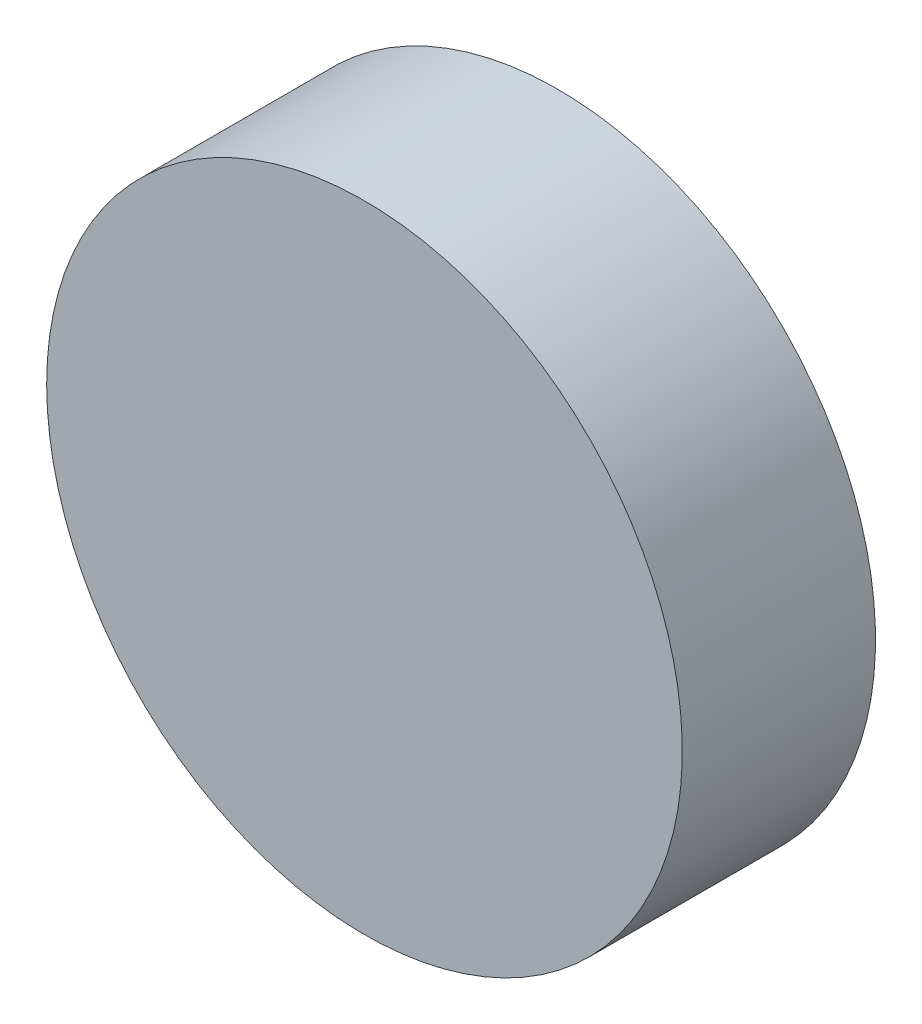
ISO-10303-21;
HEADER;
FILE_DESCRIPTION(('STEP AP214'),'2;1');
FILE_NAME('part.step','',(''),(''),'','','');
FILE_SCHEMA(('AUTOMOTIVE_DESIGN { 1 0 10303 214 1 1 1 1 }'));
ENDSEC;
DATA;
#1=APPLICATION_CONTEXT('core data for automotive mechanical design processes');
#2=APPLICATION_PROTOCOL_DEFINITION('international standard','automotive_design',2000,#1);
#3=PRODUCT_CONTEXT('',#1,'mechanical');
#4=PRODUCT('Part','Part','',(#3));
#5=PRODUCT_RELATED_PRODUCT_CATEGORY('part','',(#4));
#6=PRODUCT_DEFINITION_FORMATION('','',#4);
#7=PRODUCT_DEFINITION_CONTEXT('part definition',#1,'design');
#8=PRODUCT_DEFINITION('design','',#6,#7);
#9=PRODUCT_DEFINITION_SHAPE('','',#8);
#10=(LENGTH_UNIT() NAMED_UNIT(*) SI_UNIT(.MILLI.,.METRE.));
#11=(NAMED_UNIT(*) PLANE_ANGLE_UNIT() SI_UNIT($,.RADIAN.));
#12=(NAMED_UNIT(*) SI_UNIT($,.STERADIAN.) SOLID_ANGLE_UNIT());
#13=UNCERTAINTY_MEASURE_WITH_UNIT(LENGTH_MEASURE(1.E-05),#10,'distance_accuracy_value','');
#14=(GEOMETRIC_REPRESENTATION_CONTEXT(3) GLOBAL_UNCERTAINTY_ASSIGNED_CONTEXT((#13)) GLOBAL_UNIT_ASSIGNED_CONTEXT((#10,
#11,#12)) REPRESENTATION_CONTEXT('',''));
#15=CARTESIAN_POINT('',(0.,0.,0.));
#16=DIRECTION('',(0.,0.,1.));
#17=DIRECTION('',(1.,0.,0.));
#18=AXIS2_PLACEMENT_3D('',#15,#16,#17);
#19=CARTESIAN_POINT('',(0.,0.,3.8));
#20=DIRECTION('',(0.,0.,-1.));
#21=DIRECTION('',(-1.,0.,0.));
#22=AXIS2_PLACEMENT_3D('',#19,#20,#21);
#23=CYLINDRICAL_SURFACE('',#22,6.25);
#24=CARTESIAN_POINT('',(0.,0.,3.8));
#25=DIRECTION('',(0.,0.,1.));
#26=DIRECTION('',(1.,0.,0.));
#27=AXIS2_PLACEMENT_3D('',#24,#25,#26);
#28=CIRCLE('',#27,6.25);
#29=CARTESIAN_POINT('',(-6.25,0.,3.8));
#30=VERTEX_POINT('',#29);
#31=EDGE_CURVE('E10',#30,#30,#28,.T.);
#32=CARTESIAN_POINT('',(0.,0.,0.));
#33=DIRECTION('',(0.,0.,1.));
#34=DIRECTION('',(1.,0.,0.));
#35=AXIS2_PLACEMENT_3D('',#32,#33,#34);
#36=CIRCLE('',#35,6.25);
#37=CARTESIAN_POINT('',(-6.25,0.,0.));
#38=VERTEX_POINT('',#37);
#39=EDGE_CURVE('E40',#38,#38,#36,.T.);
#40=CARTESIAN_POINT('',(-6.25,0.,3.8));
#41=CARTESIAN_POINT('',(-6.25,0.,3.76041666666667));
#42=CARTESIAN_POINT('',(-6.25,0.,3.72083333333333));
#43=CARTESIAN_POINT('',(-6.25,0.,3.64166666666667));
#44=CARTESIAN_POINT('',(-6.25,0.,3.60208333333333));
#45=CARTESIAN_POINT('',(-6.25,0.,3.52291666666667));
#46=CARTESIAN_POINT('',(-6.25,0.,3.48333333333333));
#47=CARTESIAN_POINT('',(-6.25,0.,3.40416666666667));
#48=CARTESIAN_POINT('',(-6.25,0.,3.36458333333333));
#49=CARTESIAN_POINT('',(-6.25,0.,3.28541666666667));
#50=CARTESIAN_POINT('',(-6.25,0.,3.24583333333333));
#51=CARTESIAN_POINT('',(-6.25,0.,3.16666666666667));
#52=CARTESIAN_POINT('',(-6.25,0.,3.12708333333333));
#53=CARTESIAN_POINT('',(-6.25,0.,3.04791666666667));
#54=CARTESIAN_POINT('',(-6.25,0.,3.00833333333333));
#55=CARTESIAN_POINT('',(-6.25,0.,2.92916666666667));
#56=CARTESIAN_POINT('',(-6.25,0.,2.88958333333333));
#57=CARTESIAN_POINT('',(-6.25,0.,2.81041666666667));
#58=CARTESIAN_POINT('',(-6.25,0.,2.77083333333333));
#59=CARTESIAN_POINT('',(-6.25,0.,2.69166666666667));
#60=CARTESIAN_POINT('',(-6.25,0.,2.65208333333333));
#61=CARTESIAN_POINT('',(-6.25,0.,2.57291666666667));
#62=CARTESIAN_POINT('',(-6.25,0.,2.53333333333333));
#63=CARTESIAN_POINT('',(-6.25,0.,2.45416666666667));
#64=CARTESIAN_POINT('',(-6.25,0.,2.41458333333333));
#65=CARTESIAN_POINT('',(-6.25,0.,2.33541666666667));
#66=CARTESIAN_POINT('',(-6.25,0.,2.29583333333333));
#67=CARTESIAN_POINT('',(-6.25,0.,2.21666666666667));
#68=CARTESIAN_POINT('',(-6.25,0.,2.17708333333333));
#69=CARTESIAN_POINT('',(-6.25,0.,2.09791666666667));
#70=CARTESIAN_POINT('',(-6.25,0.,2.05833333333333));
#71=CARTESIAN_POINT('',(-6.25,0.,1.97916666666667));
#72=CARTESIAN_POINT('',(-6.25,0.,1.93958333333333));
#73=CARTESIAN_POINT('',(-6.25,0.,1.86041666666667));
#74=CARTESIAN_POINT('',(-6.25,0.,1.82083333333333));
#75=CARTESIAN_POINT('',(-6.25,0.,1.74166666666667));
#76=CARTESIAN_POINT('',(-6.25,0.,1.70208333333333));
#77=CARTESIAN_POINT('',(-6.25,0.,1.62291666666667));
#78=CARTESIAN_POINT('',(-6.25,0.,1.58333333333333));
#79=CARTESIAN_POINT('',(-6.25,0.,1.50416666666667));
#80=CARTESIAN_POINT('',(-6.25,0.,1.46458333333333));
#81=CARTESIAN_POINT('',(-6.25,0.,1.38541666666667));
#82=CARTESIAN_POINT('',(-6.25,0.,1.34583333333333));
#83=CARTESIAN_POINT('',(-6.25,0.,1.26666666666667));
#84=CARTESIAN_POINT('',(-6.25,0.,1.22708333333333));
#85=CARTESIAN_POINT('',(-6.25,0.,1.14791666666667));
#86=CARTESIAN_POINT('',(-6.25,0.,1.10833333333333));
#87=CARTESIAN_POINT('',(-6.25,0.,1.02916666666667));
#88=CARTESIAN_POINT('',(-6.25,0.,0.989583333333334));
#89=CARTESIAN_POINT('',(-6.25,0.,0.910416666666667));
#90=CARTESIAN_POINT('',(-6.25,0.,0.870833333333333));
#91=CARTESIAN_POINT('',(-6.25,0.,0.791666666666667));
#92=CARTESIAN_POINT('',(-6.25,0.,0.752083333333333));
#93=CARTESIAN_POINT('',(-6.25,0.,0.672916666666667));
#94=CARTESIAN_POINT('',(-6.25,0.,0.633333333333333));
#95=CARTESIAN_POINT('',(-6.25,0.,0.554166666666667));
#96=CARTESIAN_POINT('',(-6.25,0.,0.514583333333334));
#97=CARTESIAN_POINT('',(-6.25,0.,0.435416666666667));
#98=CARTESIAN_POINT('',(-6.25,0.,0.395833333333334));
#99=CARTESIAN_POINT('',(-6.25,0.,0.316666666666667));
#100=CARTESIAN_POINT('',(-6.25,0.,0.277083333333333));
#101=CARTESIAN_POINT('',(-6.25,0.,0.197916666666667));
#102=CARTESIAN_POINT('',(-6.25,0.,0.158333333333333));
#103=CARTESIAN_POINT('',(-6.25,0.,0.0791666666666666));
#104=CARTESIAN_POINT('',(-6.25,0.,0.0395833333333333));
#105=CARTESIAN_POINT('',(-6.25,0.,0.));
#106=B_SPLINE_CURVE_WITH_KNOTS('',3,(#40,#41,#42,#43,#44,#45,#46,#47,#48,#49,#50,#51,#52,#53,
#54,#55,#56,#57,#58,#59,#60,#61,#62,#63,#64,#65,#66,#67,#68,#69,#70,#71,#72,#73,#74,#75,#76,#77,
#78,#79,#80,#81,#82,#83,#84,#85,#86,#87,#88,#89,#90,#91,#92,#93,#94,#95,#96,#97,#98,#99,#100,
#101,#102,#103,#104,#105),.UNSPECIFIED.,.F.,.F.,(4,2,2,2,2,2,2,2,2,2,2,2,2,2,2,2,2,2,2,2,2,2,2,
2,2,2,2,2,2,2,2,2,4),(0.,0.11875,0.2375,0.35625,0.475,0.59375,0.7125,0.83125,0.95,1.06875,
1.1875,1.30625,1.425,1.54375,1.6625,1.78125,1.9,2.01875,2.1375,2.25625,2.375,2.49375,2.6125,
2.73125,2.85,2.96875,3.0875,3.20625,3.325,3.44375,3.5625,3.68125,3.8),.UNSPECIFIED.);
#107=EDGE_CURVE('BSEAM37',#30,#38,#106,.T.);
#108=ORIENTED_EDGE('',*,*,#31,.F.);
#109=ORIENTED_EDGE('',*,*,#39,.T.);
#110=ORIENTED_EDGE('',*,*,#107,.T.);
#111=ORIENTED_EDGE('',*,*,#107,.F.);
#112=EDGE_LOOP('',(#108,#110,#109,#111));
#113=FACE_BOUND('',#112,.T.);
#114=ADVANCED_FACE('F37',(#113),#23,.T.);
#115=CARTESIAN_POINT('',(0.,0.,3.8));
#116=DIRECTION('',(0.,0.,1.));
#117=DIRECTION('',(1.,0.,0.));
#118=AXIS2_PLACEMENT_3D('',#115,#116,#117);
#119=PLANE('',#118);
#120=ORIENTED_EDGE('',*,*,#31,.T.);
#121=EDGE_LOOP('',(#120));
#122=FACE_BOUND('',#121,.T.);
#123=ADVANCED_FACE('F54',(#122),#119,.T.);
#124=CARTESIAN_POINT('',(0.,0.,0.));
#125=DIRECTION('',(0.,0.,1.));
#126=DIRECTION('',(1.,0.,0.));
#127=AXIS2_PLACEMENT_3D('',#124,#125,#126);
#128=PLANE('',#127);
#129=ORIENTED_EDGE('',*,*,#39,.F.);
#130=EDGE_LOOP('',(#129));
#131=FACE_BOUND('',#130,.T.);
#132=ADVANCED_FACE('F52',(#131),#128,.F.);
#133=CLOSED_SHELL('',(#114,#123,#132));
#134=MANIFOLD_SOLID_BREP('B2',#133);
#135=ADVANCED_BREP_SHAPE_REPRESENTATION('',(#18,#134),#14);
#136=SHAPE_DEFINITION_REPRESENTATION(#9,#135);
ENDSEC;
END-ISO-10303-21;
